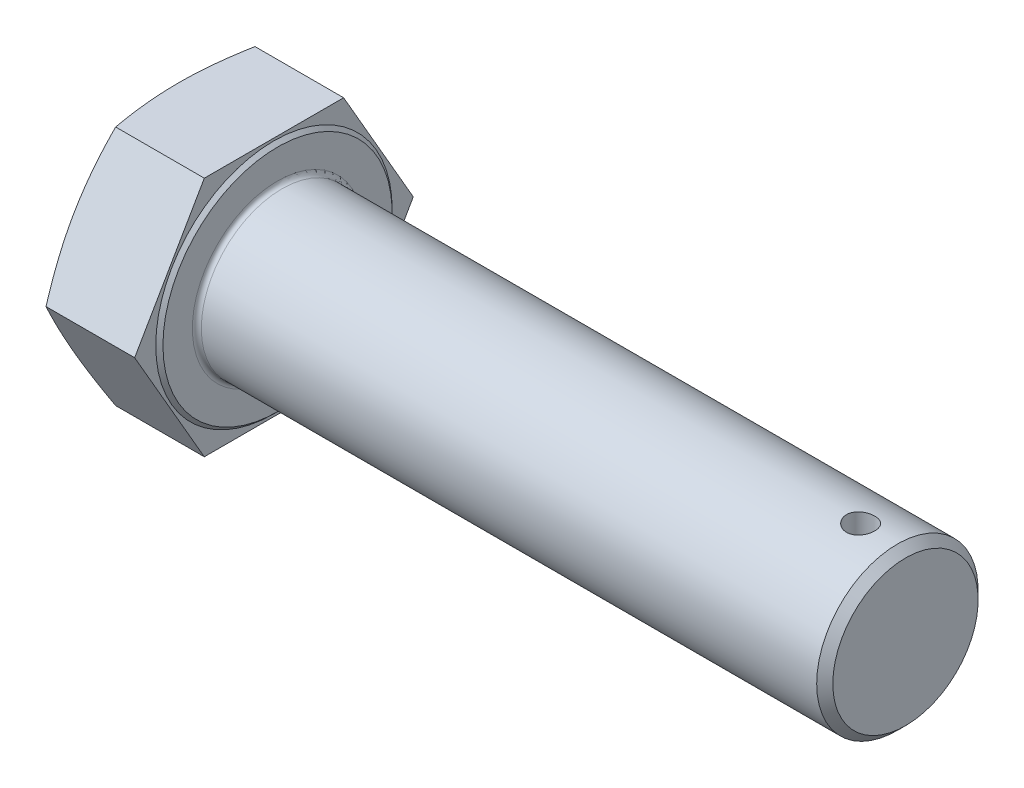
ISO-10303-21;
HEADER;
FILE_DESCRIPTION(('STEP AP214'),'2;1');
FILE_NAME('part.step','',(''),(''),'','','');
FILE_SCHEMA(('AUTOMOTIVE_DESIGN { 1 0 10303 214 1 1 1 1 }'));
ENDSEC;
DATA;
#1=APPLICATION_CONTEXT('core data for automotive mechanical design processes');
#2=APPLICATION_PROTOCOL_DEFINITION('international standard','automotive_design',2000,#1);
#3=PRODUCT_CONTEXT('',#1,'mechanical');
#4=PRODUCT('Part','Part','',(#3));
#5=PRODUCT_RELATED_PRODUCT_CATEGORY('part','',(#4));
#6=PRODUCT_DEFINITION_FORMATION('','',#4);
#7=PRODUCT_DEFINITION_CONTEXT('part definition',#1,'design');
#8=PRODUCT_DEFINITION('design','',#6,#7);
#9=PRODUCT_DEFINITION_SHAPE('','',#8);
#10=(LENGTH_UNIT() NAMED_UNIT(*) SI_UNIT(.MILLI.,.METRE.));
#11=(NAMED_UNIT(*) PLANE_ANGLE_UNIT() SI_UNIT($,.RADIAN.));
#12=(NAMED_UNIT(*) SI_UNIT($,.STERADIAN.) SOLID_ANGLE_UNIT());
#13=UNCERTAINTY_MEASURE_WITH_UNIT(LENGTH_MEASURE(1.E-05),#10,'distance_accuracy_value','');
#14=(GEOMETRIC_REPRESENTATION_CONTEXT(3) GLOBAL_UNCERTAINTY_ASSIGNED_CONTEXT((#13)) GLOBAL_UNIT_ASSIGNED_CONTEXT((#10,
#11,#12)) REPRESENTATION_CONTEXT('',''));
#15=CARTESIAN_POINT('',(0.,0.,0.));
#16=DIRECTION('',(0.,0.,1.));
#17=DIRECTION('',(1.,0.,0.));
#18=AXIS2_PLACEMENT_3D('',#15,#16,#17);
#19=CARTESIAN_POINT('',(22.08,0.,-31.0614444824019));
#20=DIRECTION('',(1.,0.,0.));
#21=DIRECTION('',(0.,0.,-1.));
#22=AXIS2_PLACEMENT_3D('',#19,#20,#21);
#23=PLANE('',#22);
#24=CARTESIAN_POINT('',(22.08,0.,0.));
#25=DIRECTION('',(1.,0.,0.));
#26=DIRECTION('',(0.,0.,-1.));
#27=AXIS2_PLACEMENT_3D('',#24,#25,#26);
#28=CIRCLE('',#27,19.);
#29=CARTESIAN_POINT('',(22.08,0.,-19.));
#30=VERTEX_POINT('',#29);
#31=EDGE_CURVE('E11',#30,#30,#28,.F.);
#32=ORIENTED_EDGE('',*,*,#31,.T.);
#33=EDGE_LOOP('',(#32));
#34=FACE_BOUND('',#33,.T.);
#35=CARTESIAN_POINT('',(22.08,0.,0.));
#36=DIRECTION('',(-1.,0.,0.));
#37=DIRECTION('',(0.,0.,1.));
#38=AXIS2_PLACEMENT_3D('',#35,#36,#37);
#39=CIRCLE('',#38,25.555);
#40=CARTESIAN_POINT('',(22.08,0.,25.555));
#41=VERTEX_POINT('',#40);
#42=EDGE_CURVE('E407',#41,#41,#39,.T.);
#43=ORIENTED_EDGE('',*,*,#42,.F.);
#44=EDGE_LOOP('',(#43));
#45=FACE_BOUND('',#44,.T.);
#46=ADVANCED_FACE('F32',(#34,#45),#23,.T.);
#47=CARTESIAN_POINT('',(22.08,-26.9,-15.5307222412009));
#48=DIRECTION('',(0.,0.5,0.866025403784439));
#49=DIRECTION('',(0.,-0.866025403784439,0.5));
#50=AXIS2_PLACEMENT_3D('',#47,#48,#49);
#51=PLANE('',#50);
#52=CARTESIAN_POINT('',(1.51468395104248,0.000200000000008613,-31.0615599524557));
#53=CARTESIAN_POINT('',(1.397628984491,-0.556880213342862,-30.739929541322));
#54=CARTESIAN_POINT('',(1.28583830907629,-1.11477913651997,-30.4178264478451));
#55=CARTESIAN_POINT('',(1.07394359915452,-2.23229041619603,-29.7726310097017));
#56=CARTESIAN_POINT('',(0.973840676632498,-2.79190293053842,-29.4495385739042));
#57=CARTESIAN_POINT('',(0.69270352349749,-4.47404053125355,-28.4783559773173));
#58=CARTESIAN_POINT('',(0.531005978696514,-5.59909558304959,-27.8288051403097));
#59=CARTESIAN_POINT('',(0.334493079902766,-7.28525346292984,-26.8553014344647));
#60=CARTESIAN_POINT('',(0.276827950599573,-7.84441085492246,-26.5324717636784));
#61=CARTESIAN_POINT('',(0.177241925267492,-8.96379540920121,-25.8861947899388));
#62=CARTESIAN_POINT('',(0.135321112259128,-9.52402257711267,-25.5627474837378));
#63=CARTESIAN_POINT('',(0.0679605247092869,-10.6450156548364,-24.9155418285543));
#64=CARTESIAN_POINT('',(0.0425147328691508,-11.2057812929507,-24.5917836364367));
#65=CARTESIAN_POINT('',(0.00853449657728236,-12.3276979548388,-23.9440447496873));
#66=CARTESIAN_POINT('',(0.,-12.8888489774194,-23.6200640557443));
#67=CARTESIAN_POINT('',(0.,-14.0111510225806,-22.9721026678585));
#68=CARTESIAN_POINT('',(0.00853449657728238,-14.5723020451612,-22.6481219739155));
#69=CARTESIAN_POINT('',(0.0425147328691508,-15.6942187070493,-22.0003830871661));
#70=CARTESIAN_POINT('',(0.0679605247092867,-16.2549843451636,-21.6766248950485));
#71=CARTESIAN_POINT('',(0.135321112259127,-17.3759774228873,-21.029419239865));
#72=CARTESIAN_POINT('',(0.17724192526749,-17.9362045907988,-20.705971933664));
#73=CARTESIAN_POINT('',(0.276827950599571,-19.0555891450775,-20.0596949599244));
#74=CARTESIAN_POINT('',(0.334493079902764,-19.6147465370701,-19.7368652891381));
#75=CARTESIAN_POINT('',(0.531005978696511,-21.3009044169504,-18.7633615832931));
#76=CARTESIAN_POINT('',(0.692703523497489,-22.4259594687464,-18.1138107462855));
#77=CARTESIAN_POINT('',(0.973840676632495,-24.1080970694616,-17.1426281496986));
#78=CARTESIAN_POINT('',(1.07394359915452,-24.667709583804,-16.8195357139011));
#79=CARTESIAN_POINT('',(1.28583830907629,-25.78522086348,-16.1743402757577));
#80=CARTESIAN_POINT('',(1.39762898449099,-26.3431197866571,-15.8522371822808));
#81=CARTESIAN_POINT('',(1.51468395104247,-26.9002,-15.5306067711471));
#82=B_SPLINE_CURVE_WITH_KNOTS('',3,(#52,#53,#54,#55,#56,#57,#58,#59,#60,#61,#62,#63,#64,#65,#66,
#67,#68,#69,#70,#71,#72,#73,#74,#75,#76,#77,#78,#79,#80,#81),.UNSPECIFIED.,.F.,.F.,(4,2,2,2,2,2,
2,2,2,2,2,2,2,2,4),(0.,1.96141494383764,3.92301634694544,7.84893078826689,9.79346540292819,
11.7380102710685,13.6818445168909,15.6256727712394,17.569501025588,19.5133352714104,
21.4578801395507,23.402414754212,27.3283291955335,29.2899305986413,31.2513455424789),.UNSPECIFIED.);
#83=CARTESIAN_POINT('',(1.51464192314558,0.,-31.0614444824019));
#84=VERTEX_POINT('',#83);
#85=CARTESIAN_POINT('',(0.,-13.45,-23.2960833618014));
#86=VERTEX_POINT('',#85);
#87=EDGE_CURVE('E111',#84,#86,#82,.T.);
#88=ORIENTED_EDGE('',*,*,#87,.F.);
#89=DIRECTION('',(-1.,0.,0.));
#90=VECTOR('',#89,1.);
#91=CARTESIAN_POINT('',(22.08,0.,-31.0614444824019));
#92=LINE('',#91,#90);
#93=CARTESIAN_POINT('',(21.28,0.,-31.0614444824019));
#94=VERTEX_POINT('',#93);
#95=EDGE_CURVE('E140',#94,#84,#92,.T.);
#96=ORIENTED_EDGE('',*,*,#95,.F.);
#97=DIRECTION('',(0.,0.866025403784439,-0.5));
#98=VECTOR('',#97,1.);
#99=CARTESIAN_POINT('',(21.28,-26.9,-15.5307222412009));
#100=LINE('',#99,#98);
#101=CARTESIAN_POINT('',(21.28,-26.9,-15.530722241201));
#102=VERTEX_POINT('',#101);
#103=EDGE_CURVE('E396',#102,#94,#100,.T.);
#104=ORIENTED_EDGE('',*,*,#103,.F.);
#105=DIRECTION('',(-1.,0.,0.));
#106=VECTOR('',#105,1.);
#107=CARTESIAN_POINT('',(22.08,-26.9,-15.5307222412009));
#108=LINE('',#107,#106);
#109=CARTESIAN_POINT('',(1.51464192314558,-26.9,-15.530722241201));
#110=VERTEX_POINT('',#109);
#111=EDGE_CURVE('E134',#102,#110,#108,.T.);
#112=ORIENTED_EDGE('',*,*,#111,.T.);
#113=EDGE_CURVE('E233',#86,#110,#82,.T.);
#114=ORIENTED_EDGE('',*,*,#113,.F.);
#115=EDGE_LOOP('',(#88,#96,#104,#112,#114));
#116=FACE_BOUND('',#115,.T.);
#117=ADVANCED_FACE('F34',(#116),#51,.F.);
#118=CARTESIAN_POINT('',(22.08,0.,-31.0614444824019));
#119=DIRECTION('',(0.,-0.500000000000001,0.866025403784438));
#120=DIRECTION('',(0.,-0.866025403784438,-0.500000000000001));
#121=AXIS2_PLACEMENT_3D('',#118,#119,#120);
#122=PLANE('',#121);
#123=CARTESIAN_POINT('',(1.51468395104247,26.9002,-15.5306067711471));
#124=CARTESIAN_POINT('',(1.39762898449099,26.3431197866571,-15.8522371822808));
#125=CARTESIAN_POINT('',(1.28583830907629,25.78522086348,-16.1743402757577));
#126=CARTESIAN_POINT('',(1.07394359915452,24.667709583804,-16.8195357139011));
#127=CARTESIAN_POINT('',(0.973840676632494,24.1080970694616,-17.1426281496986));
#128=CARTESIAN_POINT('',(0.692703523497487,22.4259594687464,-18.1138107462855));
#129=CARTESIAN_POINT('',(0.531005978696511,21.3009044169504,-18.7633615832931));
#130=CARTESIAN_POINT('',(0.334493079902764,19.6147465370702,-19.7368652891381));
#131=CARTESIAN_POINT('',(0.276827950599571,19.0555891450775,-20.0596949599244));
#132=CARTESIAN_POINT('',(0.17724192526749,17.9362045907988,-20.705971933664));
#133=CARTESIAN_POINT('',(0.135321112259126,17.3759774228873,-21.029419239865));
#134=CARTESIAN_POINT('',(0.0679605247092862,16.2549843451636,-21.6766248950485));
#135=CARTESIAN_POINT('',(0.042514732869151,15.6942187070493,-22.0003830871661));
#136=CARTESIAN_POINT('',(0.00853449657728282,14.5723020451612,-22.6481219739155));
#137=CARTESIAN_POINT('',(0.,14.0111510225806,-22.9721026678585));
#138=CARTESIAN_POINT('',(0.,12.8888489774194,-23.6200640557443));
#139=CARTESIAN_POINT('',(0.00853449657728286,12.3276979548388,-23.9440447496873));
#140=CARTESIAN_POINT('',(0.0425147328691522,11.2057812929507,-24.5917836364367));
#141=CARTESIAN_POINT('',(0.0679605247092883,10.6450156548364,-24.9155418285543));
#142=CARTESIAN_POINT('',(0.13532111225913,9.52402257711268,-25.5627474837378));
#143=CARTESIAN_POINT('',(0.177241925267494,8.96379540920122,-25.8861947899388));
#144=CARTESIAN_POINT('',(0.276827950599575,7.84441085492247,-26.5324717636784));
#145=CARTESIAN_POINT('',(0.334493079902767,7.28525346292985,-26.8553014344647));
#146=CARTESIAN_POINT('',(0.531005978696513,5.5990955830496,-27.8288051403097));
#147=CARTESIAN_POINT('',(0.692703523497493,4.47404053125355,-28.4783559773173));
#148=CARTESIAN_POINT('',(0.9738406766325,2.79190293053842,-29.4495385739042));
#149=CARTESIAN_POINT('',(1.07394359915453,2.23229041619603,-29.7726310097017));
#150=CARTESIAN_POINT('',(1.28583830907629,1.11477913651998,-30.4178264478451));
#151=CARTESIAN_POINT('',(1.397628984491,0.556880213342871,-30.739929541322));
#152=CARTESIAN_POINT('',(1.51468395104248,-0.000199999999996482,-31.0615599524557));
#153=B_SPLINE_CURVE_WITH_KNOTS('',3,(#123,#124,#125,#126,#127,#128,#129,#130,#131,#132,#133,
#134,#135,#136,#137,#138,#139,#140,#141,#142,#143,#144,#145,#146,#147,#148,#149,#150,#151,#152),
.UNSPECIFIED.,.F.,.F.,(4,2,2,2,2,2,2,2,2,2,2,2,2,2,4),(0.,1.96141494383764,3.92301634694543,
7.84893078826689,9.79346540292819,11.7380102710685,13.6818445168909,15.6256727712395,
17.569501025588,19.5133352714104,21.4578801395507,23.402414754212,27.3283291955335,
29.2899305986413,31.2513455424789),.UNSPECIFIED.);
#154=CARTESIAN_POINT('',(1.51464192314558,26.9,-15.530722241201));
#155=VERTEX_POINT('',#154);
#156=CARTESIAN_POINT('',(0.,13.45,-23.2960833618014));
#157=VERTEX_POINT('',#156);
#158=EDGE_CURVE('E244',#155,#157,#153,.T.);
#159=ORIENTED_EDGE('',*,*,#158,.F.);
#160=DIRECTION('',(-1.,0.,0.));
#161=VECTOR('',#160,1.);
#162=CARTESIAN_POINT('',(22.08,26.9,-15.5307222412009));
#163=LINE('',#162,#161);
#164=CARTESIAN_POINT('',(21.28,26.9,-15.530722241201));
#165=VERTEX_POINT('',#164);
#166=EDGE_CURVE('E131',#165,#155,#163,.T.);
#167=ORIENTED_EDGE('',*,*,#166,.F.);
#168=DIRECTION('',(0.,0.866025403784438,0.500000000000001));
#169=VECTOR('',#168,1.);
#170=CARTESIAN_POINT('',(21.28,0.,-31.0614444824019));
#171=LINE('',#170,#169);
#172=EDGE_CURVE('E398',#94,#165,#171,.T.);
#173=ORIENTED_EDGE('',*,*,#172,.F.);
#174=ORIENTED_EDGE('',*,*,#95,.T.);
#175=EDGE_CURVE('E122',#157,#84,#153,.T.);
#176=ORIENTED_EDGE('',*,*,#175,.F.);
#177=EDGE_LOOP('',(#159,#167,#173,#174,#176));
#178=FACE_BOUND('',#177,.T.);
#179=ADVANCED_FACE('F195',(#178),#122,.F.);
#180=CARTESIAN_POINT('',(22.08,26.9,-15.5307222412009));
#181=DIRECTION('',(0.,-1.,0.));
#182=DIRECTION('',(0.,0.,-1.));
#183=AXIS2_PLACEMENT_3D('',#180,#181,#182);
#184=PLANE('',#183);
#185=CARTESIAN_POINT('',(8.09364576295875,26.9,-41.1198915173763));
#186=CARTESIAN_POINT('',(7.90830433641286,26.9,-40.5113738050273));
#187=CARTESIAN_POINT('',(7.72408376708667,26.9,-39.9025148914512));
#188=CARTESIAN_POINT('',(7.35813527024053,26.9,-38.6840447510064));
#189=CARTESIAN_POINT('',(7.17640735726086,26.9,-38.0744335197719));
#190=CARTESIAN_POINT('',(6.63531556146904,26.9,-36.2442869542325));
#191=CARTESIAN_POINT('',(6.28007109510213,26.9,-35.0225286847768));
#192=CARTESIAN_POINT('',(5.58244747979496,26.9,-32.5728705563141));
#193=CARTESIAN_POINT('',(5.24009357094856,26.9,-31.3449634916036));
#194=CARTESIAN_POINT('',(4.5722297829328,26.9,-28.8845822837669));
#195=CARTESIAN_POINT('',(4.24671960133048,26.9,-27.6521082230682));
#196=CARTESIAN_POINT('',(3.62060798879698,26.9,-25.197000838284));
#197=CARTESIAN_POINT('',(3.31974892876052,26.9,-23.9744335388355));
#198=CARTESIAN_POINT('',(2.74364501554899,26.9,-21.5232150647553));
#199=CARTESIAN_POINT('',(2.46840059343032,26.9,-20.2945637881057));
#200=CARTESIAN_POINT('',(1.94994322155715,26.9,-17.830903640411));
#201=CARTESIAN_POINT('',(1.70671934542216,26.9,-16.5958970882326));
#202=CARTESIAN_POINT('',(1.2597103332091,26.9,-14.118710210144));
#203=CARTESIAN_POINT('',(1.05592387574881,26.9,-12.8765301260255));
#204=CARTESIAN_POINT('',(0.716241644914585,26.9,-10.5248872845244));
#205=CARTESIAN_POINT('',(0.575295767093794,26.9,-9.41615943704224));
#206=CARTESIAN_POINT('',(0.336719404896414,26.9,-7.19397240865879));
#207=CARTESIAN_POINT('',(0.239087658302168,26.9,-6.08051336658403));
#208=CARTESIAN_POINT('',(0.12859399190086,26.9,-4.40838470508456));
#209=CARTESIAN_POINT('',(0.0977591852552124,26.9,-3.85086246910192));
#210=CARTESIAN_POINT('',(0.0484239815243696,26.9,-2.73527685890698));
#211=CARTESIAN_POINT('',(0.0299232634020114,26.9,-2.17721349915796));
#212=CARTESIAN_POINT('',(0.0055107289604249,26.9,-1.06080724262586));
#213=CARTESIAN_POINT('',(-0.000400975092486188,26.9,-0.502464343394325));
#214=CARTESIAN_POINT('',(0.000443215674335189,26.9,0.614211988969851));
#215=CARTESIAN_POINT('',(0.0071991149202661,26.9,1.17254542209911));
#216=CARTESIAN_POINT('',(0.0333546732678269,26.9,2.29174099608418));
#217=CARTESIAN_POINT('',(0.0528180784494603,26.9,2.85260165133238));
#218=CARTESIAN_POINT('',(0.104180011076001,26.9,3.97375773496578));
#219=CARTESIAN_POINT('',(0.136078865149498,26.9,4.5340531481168));
#220=CARTESIAN_POINT('',(0.249841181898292,26.9,6.21369861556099));
#221=CARTESIAN_POINT('',(0.349771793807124,26.9,7.331864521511));
#222=CARTESIAN_POINT('',(0.593196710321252,26.9,9.56430663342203));
#223=CARTESIAN_POINT('',(0.736728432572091,26.9,10.6785786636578));
#224=CARTESIAN_POINT('',(1.06151792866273,26.9,12.9015599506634));
#225=CARTESIAN_POINT('',(1.24277590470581,26.9,14.0102691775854));
#226=CARTESIAN_POINT('',(1.64755311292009,26.9,16.2804519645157));
#227=CARTESIAN_POINT('',(1.87280061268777,26.9,17.4416144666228));
#228=CARTESIAN_POINT('',(2.35228601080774,26.9,19.7579775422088));
#229=CARTESIAN_POINT('',(2.60652609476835,26.9,20.9131776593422));
#230=CARTESIAN_POINT('',(3.13865846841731,26.9,23.2184379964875));
#231=CARTESIAN_POINT('',(3.41655762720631,26.9,24.3684966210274));
#232=CARTESIAN_POINT('',(3.99148746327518,26.9,26.6637692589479));
#233=CARTESIAN_POINT('',(4.28851768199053,26.9,27.8089833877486));
#234=CARTESIAN_POINT('',(4.89852507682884,26.9,30.0967168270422));
#235=CARTESIAN_POINT('',(5.21152224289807,26.9,31.2392307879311));
#236=CARTESIAN_POINT('',(5.85024897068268,26.9,33.5206892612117));
#237=CARTESIAN_POINT('',(6.17597858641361,26.9,34.6596337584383));
#238=CARTESIAN_POINT('',(6.83783976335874,26.9,36.9342824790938));
#239=CARTESIAN_POINT('',(7.1739695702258,26.9,38.069987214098));
#240=CARTESIAN_POINT('',(7.85487614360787,26.9,40.338794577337));
#241=CARTESIAN_POINT('',(8.19965289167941,26.9,41.4718972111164));
#242=CARTESIAN_POINT('',(8.89256675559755,26.9,43.7233837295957));
#243=CARTESIAN_POINT('',(9.24062474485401,26.9,44.8417919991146));
#244=CARTESIAN_POINT('',(9.94266960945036,26.9,47.0767443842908));
#245=CARTESIAN_POINT('',(10.2966564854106,26.9,48.193288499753));
#246=CARTESIAN_POINT('',(11.009668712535,26.9,50.4248218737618));
#247=CARTESIAN_POINT('',(11.3686942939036,26.9,51.5398110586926));
#248=CARTESIAN_POINT('',(12.0910295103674,26.9,53.7684011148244));
#249=CARTESIAN_POINT('',(12.4543391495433,26.9,54.8820019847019));
#250=CARTESIAN_POINT('',(13.1832494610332,26.9,57.1037718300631));
#251=CARTESIAN_POINT('',(13.5488362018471,26.9,58.211945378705));
#252=CARTESIAN_POINT('',(14.2831644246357,26.9,60.4272469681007));
#253=CARTESIAN_POINT('',(14.6519059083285,26.9,61.5343750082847));
#254=CARTESIAN_POINT('',(15.3920975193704,26.9,63.7476240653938));
#255=CARTESIAN_POINT('',(15.763547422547,26.9,64.8537451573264));
#256=CARTESIAN_POINT('',(16.5088507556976,26.9,67.065174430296));
#257=CARTESIAN_POINT('',(16.8827041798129,26.9,68.1704826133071));
#258=CARTESIAN_POINT('',(17.2575927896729,26.9,69.2754387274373));
#259=B_SPLINE_CURVE_WITH_KNOTS('',3,(#185,#186,#187,#188,#189,#190,#191,#192,#193,#194,#195,
#196,#197,#198,#199,#200,#201,#202,#203,#204,#205,#206,#207,#208,#209,#210,#211,#212,#213,#214,
#215,#216,#217,#218,#219,#220,#221,#222,#223,#224,#225,#226,#227,#228,#229,#230,#231,#232,#233,
#234,#235,#236,#237,#238,#239,#240,#241,#242,#243,#244,#245,#246,#247,#248,#249,#250,#251,#252,
#253,#254,#255,#256,#257,#258),.UNSPECIFIED.,.F.,.F.,(4,2,2,2,2,2,2,2,2,2,2,2,2,2,2,2,2,2,2,2,2,
2,2,2,2,2,2,2,2,2,2,2,2,2,2,2,4),(0.,1.90834994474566,3.81671101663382,7.63371526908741,
11.4578411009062,15.2818982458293,19.0588067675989,22.8357788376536,26.6114587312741,
30.3870120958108,33.7392539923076,37.0913981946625,38.7664069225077,40.4413720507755,
42.1163521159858,43.7913327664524,45.4747810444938,47.158273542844,50.5250887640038,
53.8948015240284,57.2645323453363,60.8125045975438,64.3607444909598,67.9100181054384,
71.459206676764,75.0129532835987,78.5667149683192,82.1198804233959,85.6730383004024,
89.1869673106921,92.700896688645,96.214987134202,99.7290809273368,103.229835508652,
106.730591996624,110.231061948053,113.731523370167),.UNSPECIFIED.);
#260=CARTESIAN_POINT('',(1.51464192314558,26.9,15.5307222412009));
#261=VERTEX_POINT('',#260);
#262=CARTESIAN_POINT('',(0.,26.9,0.));
#263=VERTEX_POINT('',#262);
#264=EDGE_CURVE('E48',#261,#263,#259,.F.);
#265=ORIENTED_EDGE('',*,*,#264,.F.);
#266=DIRECTION('',(-1.,0.,0.));
#267=VECTOR('',#266,1.);
#268=CARTESIAN_POINT('',(22.08,26.9,15.5307222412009));
#269=LINE('',#268,#267);
#270=CARTESIAN_POINT('',(21.28,26.9,15.5307222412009));
#271=VERTEX_POINT('',#270);
#272=EDGE_CURVE('E128',#271,#261,#269,.T.);
#273=ORIENTED_EDGE('',*,*,#272,.F.);
#274=DIRECTION('',(0.,0.,1.));
#275=VECTOR('',#274,1.);
#276=CARTESIAN_POINT('',(21.28,26.9,-15.5307222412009));
#277=LINE('',#276,#275);
#278=EDGE_CURVE('E400',#165,#271,#277,.T.);
#279=ORIENTED_EDGE('',*,*,#278,.F.);
#280=ORIENTED_EDGE('',*,*,#166,.T.);
#281=EDGE_CURVE('E245',#263,#155,#259,.F.);
#282=ORIENTED_EDGE('',*,*,#281,.F.);
#283=EDGE_LOOP('',(#265,#273,#279,#280,#282));
#284=FACE_BOUND('',#283,.T.);
#285=ADVANCED_FACE('F253',(#284),#184,.F.);
#286=CARTESIAN_POINT('',(22.08,26.9,15.5307222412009));
#287=DIRECTION('',(0.,-0.5,-0.866025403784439));
#288=DIRECTION('',(0.,0.866025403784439,-0.5));
#289=AXIS2_PLACEMENT_3D('',#286,#287,#288);
#290=PLANE('',#289);
#291=CARTESIAN_POINT('',(1.51468395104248,-0.000199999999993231,31.0615599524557));
#292=CARTESIAN_POINT('',(1.39762898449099,0.556880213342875,30.739929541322));
#293=CARTESIAN_POINT('',(1.28583830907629,1.11477913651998,30.4178264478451));
#294=CARTESIAN_POINT('',(1.07394359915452,2.23229041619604,29.7726310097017));
#295=CARTESIAN_POINT('',(0.973840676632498,2.79190293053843,29.4495385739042));
#296=CARTESIAN_POINT('',(0.692703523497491,4.47404053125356,28.4783559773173));
#297=CARTESIAN_POINT('',(0.531005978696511,5.5990955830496,27.8288051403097));
#298=CARTESIAN_POINT('',(0.334493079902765,7.28525346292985,26.8553014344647));
#299=CARTESIAN_POINT('',(0.276827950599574,7.84441085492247,26.5324717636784));
#300=CARTESIAN_POINT('',(0.177241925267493,8.96379540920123,25.8861947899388));
#301=CARTESIAN_POINT('',(0.135321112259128,9.52402257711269,25.5627474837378));
#302=CARTESIAN_POINT('',(0.0679605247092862,10.6450156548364,24.9155418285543));
#303=CARTESIAN_POINT('',(0.0425147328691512,11.2057812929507,24.5917836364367));
#304=CARTESIAN_POINT('',(0.00853449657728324,12.3276979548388,23.9440447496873));
#305=CARTESIAN_POINT('',(0.,12.8888489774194,23.6200640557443));
#306=CARTESIAN_POINT('',(0.,14.0111510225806,22.9721026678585));
#307=CARTESIAN_POINT('',(0.00853449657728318,14.5723020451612,22.6481219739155));
#308=CARTESIAN_POINT('',(0.0425147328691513,15.6942187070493,22.0003830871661));
#309=CARTESIAN_POINT('',(0.0679605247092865,16.2549843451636,21.6766248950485));
#310=CARTESIAN_POINT('',(0.135321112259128,17.3759774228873,21.029419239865));
#311=CARTESIAN_POINT('',(0.177241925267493,17.9362045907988,20.705971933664));
#312=CARTESIAN_POINT('',(0.276827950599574,19.0555891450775,20.0596949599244));
#313=CARTESIAN_POINT('',(0.334493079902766,19.6147465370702,19.7368652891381));
#314=CARTESIAN_POINT('',(0.531005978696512,21.3009044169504,18.7633615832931));
#315=CARTESIAN_POINT('',(0.692703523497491,22.4259594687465,18.1138107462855));
#316=CARTESIAN_POINT('',(0.973840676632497,24.1080970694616,17.1426281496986));
#317=CARTESIAN_POINT('',(1.07394359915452,24.667709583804,16.8195357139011));
#318=CARTESIAN_POINT('',(1.28583830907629,25.78522086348,16.1743402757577));
#319=CARTESIAN_POINT('',(1.39762898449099,26.3431197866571,15.8522371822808));
#320=CARTESIAN_POINT('',(1.51468395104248,26.9002,15.5306067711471));
#321=B_SPLINE_CURVE_WITH_KNOTS('',3,(#291,#292,#293,#294,#295,#296,#297,#298,#299,#300,#301,
#302,#303,#304,#305,#306,#307,#308,#309,#310,#311,#312,#313,#314,#315,#316,#317,#318,#319,#320),
.UNSPECIFIED.,.F.,.F.,(4,2,2,2,2,2,2,2,2,2,2,2,2,2,4),(0.,1.96141494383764,3.92301634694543,
7.84893078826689,9.79346540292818,11.7380102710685,13.6818445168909,15.6256727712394,
17.569501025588,19.5133352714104,21.4578801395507,23.402414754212,27.3283291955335,
29.2899305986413,31.2513455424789),.UNSPECIFIED.);
#322=CARTESIAN_POINT('',(1.51464192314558,0.,31.0614444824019));
#323=VERTEX_POINT('',#322);
#324=CARTESIAN_POINT('',(0.,13.45,23.2960833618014));
#325=VERTEX_POINT('',#324);
#326=EDGE_CURVE('E56',#323,#325,#321,.T.);
#327=ORIENTED_EDGE('',*,*,#326,.F.);
#328=DIRECTION('',(-1.,0.,0.));
#329=VECTOR('',#328,1.);
#330=CARTESIAN_POINT('',(22.08,0.,31.0614444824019));
#331=LINE('',#330,#329);
#332=CARTESIAN_POINT('',(21.28,0.,31.0614444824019));
#333=VERTEX_POINT('',#332);
#334=EDGE_CURVE('E119',#333,#323,#331,.T.);
#335=ORIENTED_EDGE('',*,*,#334,.F.);
#336=DIRECTION('',(0.,-0.866025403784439,0.5));
#337=VECTOR('',#336,1.);
#338=CARTESIAN_POINT('',(21.28,26.9,15.5307222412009));
#339=LINE('',#338,#337);
#340=EDGE_CURVE('E404',#271,#333,#339,.T.);
#341=ORIENTED_EDGE('',*,*,#340,.F.);
#342=ORIENTED_EDGE('',*,*,#272,.T.);
#343=EDGE_CURVE('E121',#325,#261,#321,.T.);
#344=ORIENTED_EDGE('',*,*,#343,.F.);
#345=EDGE_LOOP('',(#327,#335,#341,#342,#344));
#346=FACE_BOUND('',#345,.T.);
#347=ADVANCED_FACE('F117',(#346),#290,.F.);
#348=CARTESIAN_POINT('',(22.08,0.,31.0614444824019));
#349=DIRECTION('',(0.,0.5,-0.866025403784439));
#350=DIRECTION('',(0.,0.866025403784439,0.5));
#351=AXIS2_PLACEMENT_3D('',#348,#349,#350);
#352=PLANE('',#351);
#353=CARTESIAN_POINT('',(1.51468395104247,-26.9002,15.5306067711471));
#354=CARTESIAN_POINT('',(1.39762898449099,-26.3431197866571,15.8522371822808));
#355=CARTESIAN_POINT('',(1.28583830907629,-25.78522086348,16.1743402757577));
#356=CARTESIAN_POINT('',(1.07394359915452,-24.667709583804,16.8195357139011));
#357=CARTESIAN_POINT('',(0.973840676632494,-24.1080970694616,17.1426281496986));
#358=CARTESIAN_POINT('',(0.692703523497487,-22.4259594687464,18.1138107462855));
#359=CARTESIAN_POINT('',(0.531005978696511,-21.3009044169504,18.7633615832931));
#360=CARTESIAN_POINT('',(0.334493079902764,-19.6147465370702,19.7368652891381));
#361=CARTESIAN_POINT('',(0.276827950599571,-19.0555891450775,20.0596949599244));
#362=CARTESIAN_POINT('',(0.17724192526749,-17.9362045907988,20.705971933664));
#363=CARTESIAN_POINT('',(0.135321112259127,-17.3759774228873,21.029419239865));
#364=CARTESIAN_POINT('',(0.0679605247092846,-16.2549843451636,21.6766248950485));
#365=CARTESIAN_POINT('',(0.0425147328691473,-15.6942187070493,22.0003830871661));
#366=CARTESIAN_POINT('',(0.00853449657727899,-14.5723020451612,22.6481219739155));
#367=CARTESIAN_POINT('',(0.,-14.0111510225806,22.9721026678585));
#368=CARTESIAN_POINT('',(0.,-12.8888489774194,23.6200640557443));
#369=CARTESIAN_POINT('',(0.008534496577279,-12.3276979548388,23.9440447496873));
#370=CARTESIAN_POINT('',(0.0425147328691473,-11.2057812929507,24.5917836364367));
#371=CARTESIAN_POINT('',(0.0679605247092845,-10.6450156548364,24.9155418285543));
#372=CARTESIAN_POINT('',(0.135321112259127,-9.52402257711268,25.5627474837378));
#373=CARTESIAN_POINT('',(0.177241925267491,-8.96379540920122,25.8861947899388));
#374=CARTESIAN_POINT('',(0.276827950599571,-7.84441085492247,26.5324717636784));
#375=CARTESIAN_POINT('',(0.334493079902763,-7.28525346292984,26.8553014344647));
#376=CARTESIAN_POINT('',(0.531005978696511,-5.59909558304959,27.8288051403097));
#377=CARTESIAN_POINT('',(0.692703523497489,-4.47404053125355,28.4783559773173));
#378=CARTESIAN_POINT('',(0.973840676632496,-2.79190293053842,29.4495385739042));
#379=CARTESIAN_POINT('',(1.07394359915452,-2.23229041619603,29.7726310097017));
#380=CARTESIAN_POINT('',(1.28583830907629,-1.11477913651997,30.4178264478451));
#381=CARTESIAN_POINT('',(1.39762898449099,-0.556880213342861,30.739929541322));
#382=CARTESIAN_POINT('',(1.51468395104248,0.000200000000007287,31.0615599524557));
#383=B_SPLINE_CURVE_WITH_KNOTS('',3,(#353,#354,#355,#356,#357,#358,#359,#360,#361,#362,#363,
#364,#365,#366,#367,#368,#369,#370,#371,#372,#373,#374,#375,#376,#377,#378,#379,#380,#381,#382),
.UNSPECIFIED.,.F.,.F.,(4,2,2,2,2,2,2,2,2,2,2,2,2,2,4),(0.,1.96141494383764,3.92301634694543,
7.84893078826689,9.79346540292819,11.7380102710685,13.6818445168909,15.6256727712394,
17.569501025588,19.5133352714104,21.4578801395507,23.402414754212,27.3283291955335,
29.2899305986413,31.2513455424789),.UNSPECIFIED.);
#384=CARTESIAN_POINT('',(1.51464192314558,-26.9,15.530722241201));
#385=VERTEX_POINT('',#384);
#386=CARTESIAN_POINT('',(0.,-13.45,23.2960833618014));
#387=VERTEX_POINT('',#386);
#388=EDGE_CURVE('E113',#385,#387,#383,.T.);
#389=ORIENTED_EDGE('',*,*,#388,.F.);
#390=DIRECTION('',(-1.,0.,0.));
#391=VECTOR('',#390,1.);
#392=CARTESIAN_POINT('',(22.08,-26.9,15.5307222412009));
#393=LINE('',#392,#391);
#394=CARTESIAN_POINT('',(21.28,-26.9,15.5307222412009));
#395=VERTEX_POINT('',#394);
#396=EDGE_CURVE('E129',#395,#385,#393,.T.);
#397=ORIENTED_EDGE('',*,*,#396,.F.);
#398=DIRECTION('',(0.,-0.866025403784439,-0.5));
#399=VECTOR('',#398,1.);
#400=CARTESIAN_POINT('',(21.28,0.,31.0614444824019));
#401=LINE('',#400,#399);
#402=EDGE_CURVE('E127',#333,#395,#401,.T.);
#403=ORIENTED_EDGE('',*,*,#402,.F.);
#404=ORIENTED_EDGE('',*,*,#334,.T.);
#405=EDGE_CURVE('E103',#387,#323,#383,.T.);
#406=ORIENTED_EDGE('',*,*,#405,.F.);
#407=EDGE_LOOP('',(#389,#397,#403,#404,#406));
#408=FACE_BOUND('',#407,.T.);
#409=ADVANCED_FACE('F125',(#408),#352,.F.);
#410=CARTESIAN_POINT('',(22.08,-26.9,15.5307222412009));
#411=DIRECTION('',(0.,1.,0.));
#412=DIRECTION('',(0.,0.,1.));
#413=AXIS2_PLACEMENT_3D('',#410,#411,#412);
#414=PLANE('',#413);
#415=CARTESIAN_POINT('',(8.09364576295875,-26.9,-41.1198915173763));
#416=CARTESIAN_POINT('',(7.90830433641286,-26.9,-40.5113738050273));
#417=CARTESIAN_POINT('',(7.72408376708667,-26.9,-39.9025148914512));
#418=CARTESIAN_POINT('',(7.35813527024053,-26.9,-38.6840447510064));
#419=CARTESIAN_POINT('',(7.17640735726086,-26.9,-38.0744335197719));
#420=CARTESIAN_POINT('',(6.63531556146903,-26.9,-36.2442869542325));
#421=CARTESIAN_POINT('',(6.28007109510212,-26.9,-35.0225286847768));
#422=CARTESIAN_POINT('',(5.58244747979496,-26.9,-32.5728705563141));
#423=CARTESIAN_POINT('',(5.24009357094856,-26.9,-31.3449634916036));
#424=CARTESIAN_POINT('',(4.5722297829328,-26.9,-28.8845822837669));
#425=CARTESIAN_POINT('',(4.24671960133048,-26.9,-27.6521082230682));
#426=CARTESIAN_POINT('',(3.62060798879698,-26.9,-25.197000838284));
#427=CARTESIAN_POINT('',(3.31974892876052,-26.9,-23.9744335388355));
#428=CARTESIAN_POINT('',(2.74364501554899,-26.9,-21.5232150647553));
#429=CARTESIAN_POINT('',(2.46840059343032,-26.9,-20.2945637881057));
#430=CARTESIAN_POINT('',(1.94994322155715,-26.9,-17.830903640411));
#431=CARTESIAN_POINT('',(1.70671934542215,-26.9,-16.5958970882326));
#432=CARTESIAN_POINT('',(1.2597103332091,-26.9,-14.118710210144));
#433=CARTESIAN_POINT('',(1.05592387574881,-26.9,-12.8765301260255));
#434=CARTESIAN_POINT('',(0.716241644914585,-26.9,-10.5248872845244));
#435=CARTESIAN_POINT('',(0.575295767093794,-26.9,-9.41615943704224));
#436=CARTESIAN_POINT('',(0.336719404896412,-26.9,-7.19397240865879));
#437=CARTESIAN_POINT('',(0.239087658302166,-26.9,-6.08051336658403));
#438=CARTESIAN_POINT('',(0.128593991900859,-26.9,-4.40838470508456));
#439=CARTESIAN_POINT('',(0.0977591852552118,-26.9,-3.85086246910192));
#440=CARTESIAN_POINT('',(0.0484239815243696,-26.9,-2.73527685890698));
#441=CARTESIAN_POINT('',(0.0299232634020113,-26.9,-2.17721349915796));
#442=CARTESIAN_POINT('',(0.00551072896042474,-26.9,-1.06080724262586));
#443=CARTESIAN_POINT('',(-0.000400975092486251,-26.9,-0.502464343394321));
#444=CARTESIAN_POINT('',(0.000443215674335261,-26.9,0.614211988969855));
#445=CARTESIAN_POINT('',(0.00719911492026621,-26.9,1.17254542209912));
#446=CARTESIAN_POINT('',(0.0333546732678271,-26.9,2.29174099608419));
#447=CARTESIAN_POINT('',(0.0528180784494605,-26.9,2.85260165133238));
#448=CARTESIAN_POINT('',(0.104180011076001,-26.9,3.97375773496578));
#449=CARTESIAN_POINT('',(0.136078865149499,-26.9,4.5340531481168));
#450=CARTESIAN_POINT('',(0.249841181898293,-26.9,6.21369861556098));
#451=CARTESIAN_POINT('',(0.349771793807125,-26.9,7.33186452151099));
#452=CARTESIAN_POINT('',(0.593196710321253,-26.9,9.56430663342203));
#453=CARTESIAN_POINT('',(0.736728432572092,-26.9,10.6785786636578));
#454=CARTESIAN_POINT('',(1.06151792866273,-26.9,12.9015599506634));
#455=CARTESIAN_POINT('',(1.24277590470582,-26.9,14.0102691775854));
#456=CARTESIAN_POINT('',(1.64755311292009,-26.9,16.2804519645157));
#457=CARTESIAN_POINT('',(1.87280061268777,-26.9,17.4416144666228));
#458=CARTESIAN_POINT('',(2.35228601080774,-26.9,19.7579775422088));
#459=CARTESIAN_POINT('',(2.60652609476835,-26.9,20.9131776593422));
#460=CARTESIAN_POINT('',(3.13865846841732,-26.9,23.2184379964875));
#461=CARTESIAN_POINT('',(3.41655762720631,-26.9,24.3684966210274));
#462=CARTESIAN_POINT('',(3.99148746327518,-26.9,26.6637692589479));
#463=CARTESIAN_POINT('',(4.28851768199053,-26.9,27.8089833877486));
#464=CARTESIAN_POINT('',(4.89852507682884,-26.9,30.0967168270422));
#465=CARTESIAN_POINT('',(5.21152224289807,-26.9,31.2392307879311));
#466=CARTESIAN_POINT('',(5.85024897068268,-26.9,33.5206892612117));
#467=CARTESIAN_POINT('',(6.17597858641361,-26.9,34.6596337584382));
#468=CARTESIAN_POINT('',(6.83783976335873,-26.9,36.9342824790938));
#469=CARTESIAN_POINT('',(7.17396957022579,-26.9,38.0699872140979));
#470=CARTESIAN_POINT('',(7.85487614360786,-26.9,40.338794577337));
#471=CARTESIAN_POINT('',(8.1996528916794,-26.9,41.4718972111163));
#472=CARTESIAN_POINT('',(8.89256675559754,-26.9,43.7233837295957));
#473=CARTESIAN_POINT('',(9.240624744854,-26.9,44.8417919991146));
#474=CARTESIAN_POINT('',(9.94266960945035,-26.9,47.0767443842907));
#475=CARTESIAN_POINT('',(10.2966564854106,-26.9,48.193288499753));
#476=CARTESIAN_POINT('',(11.009668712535,-26.9,50.4248218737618));
#477=CARTESIAN_POINT('',(11.3686942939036,-26.9,51.5398110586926));
#478=CARTESIAN_POINT('',(12.0910295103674,-26.9,53.7684011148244));
#479=CARTESIAN_POINT('',(12.4543391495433,-26.9,54.8820019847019));
#480=CARTESIAN_POINT('',(13.1832494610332,-26.9,57.1037718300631));
#481=CARTESIAN_POINT('',(13.5488362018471,-26.9,58.211945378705));
#482=CARTESIAN_POINT('',(14.2831644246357,-26.9,60.4272469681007));
#483=CARTESIAN_POINT('',(14.6519059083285,-26.9,61.5343750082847));
#484=CARTESIAN_POINT('',(15.3920975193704,-26.9,63.7476240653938));
#485=CARTESIAN_POINT('',(15.763547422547,-26.9,64.8537451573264));
#486=CARTESIAN_POINT('',(16.5088507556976,-26.9,67.065174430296));
#487=CARTESIAN_POINT('',(16.8827041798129,-26.9,68.1704826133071));
#488=CARTESIAN_POINT('',(17.2575927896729,-26.9,69.2754387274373));
#489=B_SPLINE_CURVE_WITH_KNOTS('',3,(#415,#416,#417,#418,#419,#420,#421,#422,#423,#424,#425,
#426,#427,#428,#429,#430,#431,#432,#433,#434,#435,#436,#437,#438,#439,#440,#441,#442,#443,#444,
#445,#446,#447,#448,#449,#450,#451,#452,#453,#454,#455,#456,#457,#458,#459,#460,#461,#462,#463,
#464,#465,#466,#467,#468,#469,#470,#471,#472,#473,#474,#475,#476,#477,#478,#479,#480,#481,#482,
#483,#484,#485,#486,#487,#488),.UNSPECIFIED.,.F.,.F.,(4,2,2,2,2,2,2,2,2,2,2,2,2,2,2,2,2,2,2,2,2,
2,2,2,2,2,2,2,2,2,2,2,2,2,2,2,4),(0.,1.90834994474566,3.81671101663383,7.63371526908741,
11.4578411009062,15.2818982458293,19.0588067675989,22.8357788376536,26.6114587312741,
30.3870120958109,33.7392539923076,37.0913981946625,38.7664069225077,40.4413720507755,
42.1163521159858,43.7913327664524,45.4747810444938,47.158273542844,50.5250887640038,
53.8948015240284,57.2645323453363,60.8125045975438,64.3607444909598,67.9100181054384,
71.459206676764,75.0129532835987,78.5667149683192,82.1198804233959,85.6730383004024,
89.1869673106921,92.700896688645,96.214987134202,99.7290809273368,103.229835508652,
106.730591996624,110.231061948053,113.731523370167),.UNSPECIFIED.);
#490=CARTESIAN_POINT('',(0.,-26.9,0.));
#491=VERTEX_POINT('',#490);
#492=EDGE_CURVE('E215',#110,#491,#489,.T.);
#493=ORIENTED_EDGE('',*,*,#492,.F.);
#494=ORIENTED_EDGE('',*,*,#111,.F.);
#495=DIRECTION('',(0.,0.,-1.));
#496=VECTOR('',#495,1.);
#497=CARTESIAN_POINT('',(21.28,-26.9,15.5307222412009));
#498=LINE('',#497,#496);
#499=EDGE_CURVE('E143',#395,#102,#498,.T.);
#500=ORIENTED_EDGE('',*,*,#499,.F.);
#501=ORIENTED_EDGE('',*,*,#396,.T.);
#502=EDGE_CURVE('E210',#491,#385,#489,.T.);
#503=ORIENTED_EDGE('',*,*,#502,.F.);
#504=EDGE_LOOP('',(#493,#494,#500,#501,#503));
#505=FACE_BOUND('',#504,.T.);
#506=ADVANCED_FACE('F201',(#505),#414,.F.);
#507=CARTESIAN_POINT('',(21.28,0.,-26.355));
#508=DIRECTION('',(1.,0.,0.));
#509=DIRECTION('',(0.,0.,-1.));
#510=AXIS2_PLACEMENT_3D('',#507,#508,#509);
#511=PLANE('',#510);
#512=CARTESIAN_POINT('',(21.28,0.,0.));
#513=DIRECTION('',(-1.,0.,0.));
#514=DIRECTION('',(0.,0.,1.));
#515=AXIS2_PLACEMENT_3D('',#512,#513,#514);
#516=CIRCLE('',#515,26.355);
#517=CARTESIAN_POINT('',(21.28,0.,26.355));
#518=VERTEX_POINT('',#517);
#519=EDGE_CURVE('E381',#518,#518,#516,.T.);
#520=ORIENTED_EDGE('',*,*,#519,.T.);
#521=EDGE_LOOP('',(#520));
#522=FACE_BOUND('',#521,.T.);
#523=ORIENTED_EDGE('',*,*,#103,.T.);
#524=ORIENTED_EDGE('',*,*,#172,.T.);
#525=ORIENTED_EDGE('',*,*,#278,.T.);
#526=ORIENTED_EDGE('',*,*,#340,.T.);
#527=ORIENTED_EDGE('',*,*,#402,.T.);
#528=ORIENTED_EDGE('',*,*,#499,.T.);
#529=EDGE_LOOP('',(#523,#524,#525,#526,#527,#528));
#530=FACE_BOUND('',#529,.T.);
#531=ADVANCED_FACE('F205',(#522,#530),#511,.T.);
#532=CARTESIAN_POINT('',(21.28,0.,0.));
#533=DIRECTION('',(-1.,0.,0.));
#534=DIRECTION('',(0.,0.,1.));
#535=AXIS2_PLACEMENT_3D('',#532,#533,#534);
#536=CONICAL_SURFACE('',#535,26.355,0.785398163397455);
#537=ORIENTED_EDGE('',*,*,#42,.T.);
#538=EDGE_LOOP('',(#537));
#539=FACE_BOUND('',#538,.T.);
#540=ORIENTED_EDGE('',*,*,#519,.F.);
#541=EDGE_LOOP('',(#540));
#542=FACE_BOUND('',#541,.T.);
#543=ADVANCED_FACE('F276',(#539,#542),#536,.T.);
#544=CARTESIAN_POINT('',(0.,0.,0.));
#545=DIRECTION('',(1.,0.,0.));
#546=DIRECTION('',(0.,0.,-1.));
#547=AXIS2_PLACEMENT_3D('',#544,#545,#546);
#548=CONICAL_SURFACE('',#547,26.9,1.22173047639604);
#549=ORIENTED_EDGE('',*,*,#175,.T.);
#550=ORIENTED_EDGE('',*,*,#87,.T.);
#551=CARTESIAN_POINT('',(0.,0.,0.));
#552=DIRECTION('',(1.,0.,0.));
#553=DIRECTION('',(0.,0.,-1.));
#554=AXIS2_PLACEMENT_3D('',#551,#552,#553);
#555=CIRCLE('',#554,26.9);
#556=EDGE_CURVE('E145',#86,#157,#555,.T.);
#557=ORIENTED_EDGE('',*,*,#556,.T.);
#558=EDGE_LOOP('',(#549,#550,#557));
#559=FACE_BOUND('',#558,.T.);
#560=ADVANCED_FACE('F283',(#559),#548,.T.);
#561=ORIENTED_EDGE('',*,*,#113,.T.);
#562=ORIENTED_EDGE('',*,*,#492,.T.);
#563=EDGE_CURVE('E148',#491,#86,#555,.T.);
#564=ORIENTED_EDGE('',*,*,#563,.T.);
#565=EDGE_LOOP('',(#561,#562,#564));
#566=FACE_BOUND('',#565,.T.);
#567=ADVANCED_FACE('F290',(#566),#548,.T.);
#568=ORIENTED_EDGE('',*,*,#388,.T.);
#569=EDGE_CURVE('E394',#387,#491,#555,.T.);
#570=ORIENTED_EDGE('',*,*,#569,.T.);
#571=ORIENTED_EDGE('',*,*,#502,.T.);
#572=EDGE_LOOP('',(#568,#570,#571));
#573=FACE_BOUND('',#572,.T.);
#574=ADVANCED_FACE('F226',(#573),#548,.T.);
#575=ORIENTED_EDGE('',*,*,#326,.T.);
#576=EDGE_CURVE('E106',#325,#387,#555,.T.);
#577=ORIENTED_EDGE('',*,*,#576,.T.);
#578=ORIENTED_EDGE('',*,*,#405,.T.);
#579=EDGE_LOOP('',(#575,#577,#578));
#580=FACE_BOUND('',#579,.T.);
#581=ADVANCED_FACE('F104',(#580),#548,.T.);
#582=ORIENTED_EDGE('',*,*,#264,.T.);
#583=CARTESIAN_POINT('',(0.,0.,0.));
#584=DIRECTION('',(-1.,0.,0.));
#585=DIRECTION('',(0.,0.,1.));
#586=AXIS2_PLACEMENT_3D('',#583,#584,#585);
#587=CIRCLE('',#586,26.9);
#588=EDGE_CURVE('E216',#325,#263,#587,.T.);
#589=ORIENTED_EDGE('',*,*,#588,.F.);
#590=ORIENTED_EDGE('',*,*,#343,.T.);
#591=EDGE_LOOP('',(#582,#589,#590));
#592=FACE_BOUND('',#591,.T.);
#593=ADVANCED_FACE('F221',(#592),#548,.T.);
#594=ORIENTED_EDGE('',*,*,#281,.T.);
#595=ORIENTED_EDGE('',*,*,#158,.T.);
#596=EDGE_CURVE('E149',#157,#263,#555,.T.);
#597=ORIENTED_EDGE('',*,*,#596,.T.);
#598=EDGE_LOOP('',(#594,#595,#597));
#599=FACE_BOUND('',#598,.T.);
#600=ADVANCED_FACE('F225',(#599),#548,.T.);
#601=CARTESIAN_POINT('',(0.,0.,-31.0614444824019));
#602=DIRECTION('',(1.,0.,0.));
#603=DIRECTION('',(0.,0.,-1.));
#604=AXIS2_PLACEMENT_3D('',#601,#602,#603);
#605=PLANE('',#604);
#606=ORIENTED_EDGE('',*,*,#596,.F.);
#607=ORIENTED_EDGE('',*,*,#556,.F.);
#608=ORIENTED_EDGE('',*,*,#563,.F.);
#609=ORIENTED_EDGE('',*,*,#569,.F.);
#610=ORIENTED_EDGE('',*,*,#576,.F.);
#611=ORIENTED_EDGE('',*,*,#588,.T.);
#612=EDGE_LOOP('',(#606,#607,#608,#609,#610,#611));
#613=FACE_BOUND('',#612,.T.);
#614=ADVANCED_FACE('F187',(#613),#605,.F.);
#615=CARTESIAN_POINT('',(162.08,0.,0.));
#616=DIRECTION('',(-1.,0.,0.));
#617=DIRECTION('',(0.,0.,1.));
#618=AXIS2_PLACEMENT_3D('',#615,#616,#617);
#619=CYLINDRICAL_SURFACE('',#618,18.);
#620=CARTESIAN_POINT('',(23.08,0.,0.));
#621=DIRECTION('',(1.,0.,0.));
#622=DIRECTION('',(0.,0.,-1.));
#623=AXIS2_PLACEMENT_3D('',#620,#621,#622);
#624=CIRCLE('',#623,18.);
#625=CARTESIAN_POINT('',(23.08,0.,-18.));
#626=VERTEX_POINT('',#625);
#627=EDGE_CURVE('E41',#626,#626,#624,.T.);
#628=ORIENTED_EDGE('',*,*,#627,.T.);
#629=EDGE_LOOP('',(#628));
#630=FACE_BOUND('',#629,.T.);
#631=CARTESIAN_POINT('',(152.08,-17.7222318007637,3.14999999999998));
#632=CARTESIAN_POINT('',(152.255477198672,-17.7222350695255,3.1499930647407));
#633=CARTESIAN_POINT('',(152.431046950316,-17.72486630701,3.1352873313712));
#634=CARTESIAN_POINT('',(152.777250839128,-17.7350960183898,3.07688393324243));
#635=CARTESIAN_POINT('',(152.947880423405,-17.7426989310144,3.03316036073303));
#636=CARTESIAN_POINT('',(153.279143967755,-17.7619851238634,2.91809246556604));
#637=CARTESIAN_POINT('',(153.439786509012,-17.7736648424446,2.84677224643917));
#638=CARTESIAN_POINT('',(153.746811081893,-17.7997844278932,2.67859715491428));
#639=CARTESIAN_POINT('',(153.893194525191,-17.8142240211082,2.58174481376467));
#640=CARTESIAN_POINT('',(154.169149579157,-17.8444114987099,2.36413360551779));
#641=CARTESIAN_POINT('',(154.298543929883,-17.8601707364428,2.24315149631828));
#642=CARTESIAN_POINT('',(154.535306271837,-17.8911212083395,1.98119748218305));
#643=CARTESIAN_POINT('',(154.642672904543,-17.9063124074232,1.84022434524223));
#644=CARTESIAN_POINT('',(154.833002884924,-17.9345359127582,1.54113517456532));
#645=CARTESIAN_POINT('',(154.915800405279,-17.9475533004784,1.38291208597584));
#646=CARTESIAN_POINT('',(155.053575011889,-17.9698358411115,1.0545368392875));
#647=CARTESIAN_POINT('',(155.108554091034,-17.9791012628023,0.884385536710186));
#648=CARTESIAN_POINT('',(155.188586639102,-17.9927557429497,0.538817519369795));
#649=CARTESIAN_POINT('',(155.213938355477,-17.9971933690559,0.363471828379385));
#650=CARTESIAN_POINT('',(155.234924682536,-18.0008593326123,0.0109633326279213));
#651=CARTESIAN_POINT('',(155.230561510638,-18.0000880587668,-0.16619933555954));
#652=CARTESIAN_POINT('',(155.192473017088,-17.9934613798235,-0.515271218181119));
#653=CARTESIAN_POINT('',(155.159068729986,-17.9876615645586,-0.68721666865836));
#654=CARTESIAN_POINT('',(155.064352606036,-17.9716915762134,-1.02302357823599));
#655=CARTESIAN_POINT('',(155.003039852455,-17.9615212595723,-1.18688477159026));
#656=CARTESIAN_POINT('',(154.853933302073,-17.9378590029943,-1.50281737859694));
#657=CARTESIAN_POINT('',(154.76600875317,-17.9243507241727,-1.65482580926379));
#658=CARTESIAN_POINT('',(154.566270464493,-17.8955106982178,-1.94205168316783));
#659=CARTESIAN_POINT('',(154.454454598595,-17.8801787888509,-2.07726763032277));
#660=CARTESIAN_POINT('',(154.208331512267,-17.8491520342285,-2.32896915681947));
#661=CARTESIAN_POINT('',(154.073743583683,-17.8334550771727,-2.44518015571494));
#662=CARTESIAN_POINT('',(153.786838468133,-17.8036647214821,-2.65341695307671));
#663=CARTESIAN_POINT('',(153.634521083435,-17.789571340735,-2.74544248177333));
#664=CARTESIAN_POINT('',(153.316144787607,-17.7645819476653,-2.90275935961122));
#665=CARTESIAN_POINT('',(153.150067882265,-17.7536902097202,-2.96801501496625));
#666=CARTESIAN_POINT('',(152.809075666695,-17.7364058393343,-3.06962380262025));
#667=CARTESIAN_POINT('',(152.63416122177,-17.7300127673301,-3.10597975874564));
#668=CARTESIAN_POINT('',(152.28292330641,-17.7225353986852,-3.14836500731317));
#669=CARTESIAN_POINT('',(152.106648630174,-17.721382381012,-3.15478690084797));
#670=CARTESIAN_POINT('',(151.755544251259,-17.7243322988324,-3.13817034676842));
#671=CARTESIAN_POINT('',(151.580714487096,-17.7284350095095,-3.11513315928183));
#672=CARTESIAN_POINT('',(151.238726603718,-17.7413704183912,-3.04058802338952));
#673=CARTESIAN_POINT('',(151.071523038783,-17.7501695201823,-2.98928221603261));
#674=CARTESIAN_POINT('',(150.748086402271,-17.7714777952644,-2.85986917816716));
#675=CARTESIAN_POINT('',(150.591854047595,-17.7839872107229,-2.78176019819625));
#676=CARTESIAN_POINT('',(150.293054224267,-17.8114650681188,-2.60004036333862));
#677=CARTESIAN_POINT('',(150.150641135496,-17.8264571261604,-2.49617929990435));
#678=CARTESIAN_POINT('',(149.885123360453,-17.8571430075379,-2.26624461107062));
#679=CARTESIAN_POINT('',(149.762020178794,-17.8728368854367,-2.14016925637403));
#680=CARTESIAN_POINT('',(149.537170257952,-17.9033768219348,-1.86763991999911));
#681=CARTESIAN_POINT('',(149.435686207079,-17.9182110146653,-1.72096767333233));
#682=CARTESIAN_POINT('',(149.258800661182,-17.9451663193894,-1.41242764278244));
#683=CARTESIAN_POINT('',(149.183398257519,-17.9572875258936,-1.25056038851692));
#684=CARTESIAN_POINT('',(149.061219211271,-17.9773997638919,-0.916984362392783));
#685=CARTESIAN_POINT('',(149.014308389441,-17.9854101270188,-0.745325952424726));
#686=CARTESIAN_POINT('',(148.950013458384,-17.9964801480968,-0.396414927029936));
#687=CARTESIAN_POINT('',(148.93262665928,-17.9995402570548,-0.219162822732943));
#688=CARTESIAN_POINT('',(148.92795702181,-18.0003576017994,0.133375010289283));
#689=CARTESIAN_POINT('',(148.940275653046,-17.998185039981,0.308655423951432));
#690=CARTESIAN_POINT('',(148.993801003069,-17.9889254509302,0.654609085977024));
#691=CARTESIAN_POINT('',(149.035007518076,-17.9818384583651,0.825282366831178));
#692=CARTESIAN_POINT('',(149.144980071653,-17.9635443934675,1.15700207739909));
#693=CARTESIAN_POINT('',(149.213708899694,-17.9523428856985,1.31806116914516));
#694=CARTESIAN_POINT('',(149.376729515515,-17.9270386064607,1.62642244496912));
#695=CARTESIAN_POINT('',(149.471022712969,-17.9129356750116,1.77372386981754));
#696=CARTESIAN_POINT('',(149.683892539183,-17.8831656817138,2.052387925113));
#697=CARTESIAN_POINT('',(149.802759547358,-17.8674811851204,2.18352689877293));
#698=CARTESIAN_POINT('',(150.060795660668,-17.8364322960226,2.42413651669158));
#699=CARTESIAN_POINT('',(150.199969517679,-17.8210679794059,2.5336020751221));
#700=CARTESIAN_POINT('',(150.49597783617,-17.7922674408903,2.72855920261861));
#701=CARTESIAN_POINT('',(150.652943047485,-17.7788473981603,2.81385468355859));
#702=CARTESIAN_POINT('',(150.979150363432,-17.7556472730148,2.95673353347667));
#703=CARTESIAN_POINT('',(151.148380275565,-17.7458636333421,3.01434400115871));
#704=CARTESIAN_POINT('',(151.44517503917,-17.7331640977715,3.08801386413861));
#705=CARTESIAN_POINT('',(151.57096456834,-17.7290878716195,3.11122040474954));
#706=CARTESIAN_POINT('',(151.824486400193,-17.7236205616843,3.14221583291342));
#707=CARTESIAN_POINT('',(151.952218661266,-17.7222294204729,3.15000505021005));
#708=CARTESIAN_POINT('',(152.08,-17.7222318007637,3.14999999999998));
#709=B_SPLINE_CURVE_WITH_KNOTS('',3,(#631,#632,#633,#634,#635,#636,#637,#638,#639,#640,#641,
#642,#643,#644,#645,#646,#647,#648,#649,#650,#651,#652,#653,#654,#655,#656,#657,#658,#659,#660,
#661,#662,#663,#664,#665,#666,#667,#668,#669,#670,#671,#672,#673,#674,#675,#676,#677,#678,#679,
#680,#681,#682,#683,#684,#685,#686,#687,#688,#689,#690,#691,#692,#693,#694,#695,#696,#697,#698,
#699,#700,#701,#702,#703,#704,#705,#706,#707,#708),.UNSPECIFIED.,.T.,.F.,(4,2,2,2,2,2,2,2,2,2,2,
2,2,2,2,2,2,2,2,2,2,2,2,2,2,2,2,2,2,2,2,2,2,2,2,2,2,2,4),(0.,0.525964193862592,1.0523986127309,
1.57837426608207,2.10429779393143,2.6353338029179,3.16640255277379,3.7009781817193,
4.23551550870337,4.76462419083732,5.29369338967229,5.81698731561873,6.34029843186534,
6.86622367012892,7.39219573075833,7.925199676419,8.45820956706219,8.99192785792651,
9.52559399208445,10.0522407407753,10.5788649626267,11.1017714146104,11.6247120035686,
12.1529475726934,12.6812242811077,13.2155938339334,13.7499447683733,14.281759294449,
14.8135253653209,15.3381970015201,15.86286493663,16.3868258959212,16.9108157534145,
17.4413930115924,17.9720946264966,18.5069859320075,19.0413526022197,19.4243644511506,
19.8073681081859),.UNSPECIFIED.);
#710=CARTESIAN_POINT('',(152.08,-17.7222318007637,3.14999999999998));
#711=VERTEX_POINT('',#710);
#712=EDGE_CURVE('E163',#711,#711,#709,.T.);
#713=ORIENTED_EDGE('',*,*,#712,.T.);
#714=EDGE_LOOP('',(#713));
#715=FACE_BOUND('',#714,.T.);
#716=CARTESIAN_POINT('',(152.08,17.7222318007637,3.14999999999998));
#717=CARTESIAN_POINT('',(151.904522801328,17.7222350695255,3.1499930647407));
#718=CARTESIAN_POINT('',(151.728953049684,17.72486630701,3.1352873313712));
#719=CARTESIAN_POINT('',(151.382749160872,17.7350960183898,3.07688393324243));
#720=CARTESIAN_POINT('',(151.212119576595,17.7426989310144,3.03316036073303));
#721=CARTESIAN_POINT('',(150.880856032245,17.7619851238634,2.91809246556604));
#722=CARTESIAN_POINT('',(150.720213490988,17.7736648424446,2.84677224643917));
#723=CARTESIAN_POINT('',(150.413188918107,17.7997844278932,2.67859715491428));
#724=CARTESIAN_POINT('',(150.266805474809,17.8142240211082,2.58174481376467));
#725=CARTESIAN_POINT('',(149.990850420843,17.8444114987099,2.36413360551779));
#726=CARTESIAN_POINT('',(149.861456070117,17.8601707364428,2.24315149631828));
#727=CARTESIAN_POINT('',(149.624693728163,17.8911212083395,1.98119748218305));
#728=CARTESIAN_POINT('',(149.517327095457,17.9063124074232,1.84022434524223));
#729=CARTESIAN_POINT('',(149.326997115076,17.9345359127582,1.54113517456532));
#730=CARTESIAN_POINT('',(149.244199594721,17.9475533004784,1.38291208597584));
#731=CARTESIAN_POINT('',(149.106424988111,17.9698358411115,1.0545368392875));
#732=CARTESIAN_POINT('',(149.051445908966,17.9791012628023,0.884385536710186));
#733=CARTESIAN_POINT('',(148.971413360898,17.9927557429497,0.538817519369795));
#734=CARTESIAN_POINT('',(148.946061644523,17.9971933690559,0.363471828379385));
#735=CARTESIAN_POINT('',(148.925075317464,18.0008593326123,0.0109633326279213));
#736=CARTESIAN_POINT('',(148.929438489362,18.0000880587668,-0.16619933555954));
#737=CARTESIAN_POINT('',(148.967526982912,17.9934613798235,-0.515271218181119));
#738=CARTESIAN_POINT('',(149.000931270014,17.9876615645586,-0.68721666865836));
#739=CARTESIAN_POINT('',(149.095647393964,17.9716915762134,-1.02302357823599));
#740=CARTESIAN_POINT('',(149.156960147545,17.9615212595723,-1.18688477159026));
#741=CARTESIAN_POINT('',(149.306066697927,17.9378590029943,-1.50281737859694));
#742=CARTESIAN_POINT('',(149.39399124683,17.9243507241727,-1.65482580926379));
#743=CARTESIAN_POINT('',(149.593729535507,17.8955106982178,-1.94205168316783));
#744=CARTESIAN_POINT('',(149.705545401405,17.8801787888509,-2.07726763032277));
#745=CARTESIAN_POINT('',(149.951668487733,17.8491520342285,-2.32896915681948));
#746=CARTESIAN_POINT('',(150.086256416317,17.8334550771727,-2.44518015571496));
#747=CARTESIAN_POINT('',(150.373161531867,17.8036647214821,-2.65341695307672));
#748=CARTESIAN_POINT('',(150.525478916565,17.789571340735,-2.74544248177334));
#749=CARTESIAN_POINT('',(150.843855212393,17.7645819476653,-2.90275935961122));
#750=CARTESIAN_POINT('',(151.009932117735,17.7536902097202,-2.96801501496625));
#751=CARTESIAN_POINT('',(151.350924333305,17.7364058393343,-3.06962380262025));
#752=CARTESIAN_POINT('',(151.52583877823,17.7300127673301,-3.10597975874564));
#753=CARTESIAN_POINT('',(151.87707669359,17.7225353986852,-3.14836500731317));
#754=CARTESIAN_POINT('',(152.053351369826,17.721382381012,-3.15478690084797));
#755=CARTESIAN_POINT('',(152.404455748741,17.7243322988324,-3.13817034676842));
#756=CARTESIAN_POINT('',(152.579285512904,17.7284350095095,-3.11513315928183));
#757=CARTESIAN_POINT('',(152.921273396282,17.7413704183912,-3.04058802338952));
#758=CARTESIAN_POINT('',(153.088476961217,17.7501695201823,-2.98928221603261));
#759=CARTESIAN_POINT('',(153.411913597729,17.7714777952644,-2.85986917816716));
#760=CARTESIAN_POINT('',(153.568145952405,17.7839872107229,-2.78176019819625));
#761=CARTESIAN_POINT('',(153.866945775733,17.8114650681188,-2.60004036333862));
#762=CARTESIAN_POINT('',(154.009358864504,17.8264571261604,-2.49617929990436));
#763=CARTESIAN_POINT('',(154.274876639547,17.8571430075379,-2.26624461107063));
#764=CARTESIAN_POINT('',(154.397979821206,17.8728368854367,-2.14016925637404));
#765=CARTESIAN_POINT('',(154.622829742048,17.9033768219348,-1.86763991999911));
#766=CARTESIAN_POINT('',(154.724313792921,17.9182110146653,-1.72096767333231));
#767=CARTESIAN_POINT('',(154.901199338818,17.9451663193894,-1.41242764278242));
#768=CARTESIAN_POINT('',(154.976601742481,17.9572875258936,-1.25056038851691));
#769=CARTESIAN_POINT('',(155.098780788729,17.9773997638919,-0.916984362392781));
#770=CARTESIAN_POINT('',(155.145691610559,17.9854101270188,-0.74532595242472));
#771=CARTESIAN_POINT('',(155.209986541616,17.9964801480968,-0.396414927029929));
#772=CARTESIAN_POINT('',(155.22737334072,17.9995402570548,-0.219162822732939));
#773=CARTESIAN_POINT('',(155.23204297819,18.0003576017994,0.133375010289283));
#774=CARTESIAN_POINT('',(155.219724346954,17.998185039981,0.308655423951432));
#775=CARTESIAN_POINT('',(155.166198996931,17.9889254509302,0.654609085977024));
#776=CARTESIAN_POINT('',(155.124992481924,17.9818384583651,0.825282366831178));
#777=CARTESIAN_POINT('',(155.015019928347,17.9635443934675,1.15700207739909));
#778=CARTESIAN_POINT('',(154.946291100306,17.9523428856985,1.31806116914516));
#779=CARTESIAN_POINT('',(154.783270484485,17.9270386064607,1.62642244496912));
#780=CARTESIAN_POINT('',(154.688977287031,17.9129356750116,1.77372386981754));
#781=CARTESIAN_POINT('',(154.476107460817,17.8831656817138,2.052387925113));
#782=CARTESIAN_POINT('',(154.357240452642,17.8674811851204,2.18352689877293));
#783=CARTESIAN_POINT('',(154.099204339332,17.8364322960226,2.42413651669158));
#784=CARTESIAN_POINT('',(153.960030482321,17.8210679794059,2.5336020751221));
#785=CARTESIAN_POINT('',(153.66402216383,17.7922674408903,2.72855920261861));
#786=CARTESIAN_POINT('',(153.507056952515,17.7788473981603,2.81385468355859));
#787=CARTESIAN_POINT('',(153.180849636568,17.7556472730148,2.95673353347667));
#788=CARTESIAN_POINT('',(153.011619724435,17.7458636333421,3.01434400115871));
#789=CARTESIAN_POINT('',(152.71482496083,17.7331640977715,3.08801386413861));
#790=CARTESIAN_POINT('',(152.58903543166,17.7290878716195,3.11122040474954));
#791=CARTESIAN_POINT('',(152.335513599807,17.7236205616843,3.14221583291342));
#792=CARTESIAN_POINT('',(152.207781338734,17.7222294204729,3.15000505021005));
#793=CARTESIAN_POINT('',(152.08,17.7222318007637,3.14999999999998));
#794=B_SPLINE_CURVE_WITH_KNOTS('',3,(#716,#717,#718,#719,#720,#721,#722,#723,#724,#725,#726,
#727,#728,#729,#730,#731,#732,#733,#734,#735,#736,#737,#738,#739,#740,#741,#742,#743,#744,#745,
#746,#747,#748,#749,#750,#751,#752,#753,#754,#755,#756,#757,#758,#759,#760,#761,#762,#763,#764,
#765,#766,#767,#768,#769,#770,#771,#772,#773,#774,#775,#776,#777,#778,#779,#780,#781,#782,#783,
#784,#785,#786,#787,#788,#789,#790,#791,#792,#793),.UNSPECIFIED.,.T.,.F.,(4,2,2,2,2,2,2,2,2,2,2,
2,2,2,2,2,2,2,2,2,2,2,2,2,2,2,2,2,2,2,2,2,2,2,2,2,2,2,4),(0.,0.525964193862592,1.0523986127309,
1.57837426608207,2.10429779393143,2.6353338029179,3.16640255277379,3.7009781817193,
4.23551550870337,4.76462419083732,5.29369338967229,5.81698731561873,6.34029843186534,
6.86622367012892,7.39219573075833,7.92519967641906,8.45820956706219,8.99192785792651,
9.52559399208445,10.0522407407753,10.5788649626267,11.1017714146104,11.6247120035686,
12.1529475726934,12.6812242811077,13.2155938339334,13.7499447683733,14.281759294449,
14.8135253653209,15.3381970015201,15.86286493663,16.3868258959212,16.9108157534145,
17.4413930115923,17.9720946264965,18.5069859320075,19.0413526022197,19.4243644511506,
19.8073681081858),.UNSPECIFIED.);
#795=CARTESIAN_POINT('',(152.08,17.7222318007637,3.14999999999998));
#796=VERTEX_POINT('',#795);
#797=EDGE_CURVE('E156',#796,#796,#794,.T.);
#798=ORIENTED_EDGE('',*,*,#797,.T.);
#799=EDGE_LOOP('',(#798));
#800=FACE_BOUND('',#799,.T.);
#801=CARTESIAN_POINT('',(160.28,0.,0.));
#802=DIRECTION('',(1.,0.,0.));
#803=DIRECTION('',(0.,0.,-1.));
#804=AXIS2_PLACEMENT_3D('',#801,#802,#803);
#805=CIRCLE('',#804,18.);
#806=CARTESIAN_POINT('',(160.28,0.,18.));
#807=VERTEX_POINT('',#806);
#808=EDGE_CURVE('E153',#807,#807,#805,.F.);
#809=ORIENTED_EDGE('',*,*,#808,.T.);
#810=EDGE_LOOP('',(#809));
#811=FACE_BOUND('',#810,.T.);
#812=ADVANCED_FACE('F166',(#630,#715,#800,#811),#619,.T.);
#813=CARTESIAN_POINT('',(162.08,0.,0.));
#814=DIRECTION('',(1.,0.,0.));
#815=DIRECTION('',(0.,0.,-1.));
#816=AXIS2_PLACEMENT_3D('',#813,#814,#815);
#817=PLANE('',#816);
#818=CARTESIAN_POINT('',(162.08,0.,0.));
#819=DIRECTION('',(1.,0.,0.));
#820=DIRECTION('',(0.,0.,-1.));
#821=AXIS2_PLACEMENT_3D('',#818,#819,#820);
#822=CIRCLE('',#821,16.2);
#823=CARTESIAN_POINT('',(162.08,0.,16.2));
#824=VERTEX_POINT('',#823);
#825=EDGE_CURVE('E150',#824,#824,#822,.T.);
#826=ORIENTED_EDGE('',*,*,#825,.T.);
#827=EDGE_LOOP('',(#826));
#828=FACE_BOUND('',#827,.T.);
#829=ADVANCED_FACE('F180',(#828),#817,.T.);
#830=CARTESIAN_POINT('',(162.08,0.,0.));
#831=DIRECTION('',(-1.,0.,0.));
#832=DIRECTION('',(0.,0.,1.));
#833=AXIS2_PLACEMENT_3D('',#830,#831,#832);
#834=CONICAL_SURFACE('',#833,16.2,0.785398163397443);
#835=CARTESIAN_POINT('',(160.28,0.,18.));
#836=CARTESIAN_POINT('',(160.29875,0.,17.98125));
#837=CARTESIAN_POINT('',(160.3175,0.,17.9625));
#838=CARTESIAN_POINT('',(160.355,0.,17.925));
#839=CARTESIAN_POINT('',(160.37375,0.,17.90625));
#840=CARTESIAN_POINT('',(160.41125,0.,17.86875));
#841=CARTESIAN_POINT('',(160.43,0.,17.85));
#842=CARTESIAN_POINT('',(160.4675,0.,17.8125));
#843=CARTESIAN_POINT('',(160.48625,0.,17.79375));
#844=CARTESIAN_POINT('',(160.52375,0.,17.75625));
#845=CARTESIAN_POINT('',(160.5425,0.,17.7375));
#846=CARTESIAN_POINT('',(160.58,0.,17.7));
#847=CARTESIAN_POINT('',(160.59875,0.,17.68125));
#848=CARTESIAN_POINT('',(160.63625,0.,17.64375));
#849=CARTESIAN_POINT('',(160.655,0.,17.625));
#850=CARTESIAN_POINT('',(160.6925,0.,17.5875));
#851=CARTESIAN_POINT('',(160.71125,0.,17.56875));
#852=CARTESIAN_POINT('',(160.74875,0.,17.53125));
#853=CARTESIAN_POINT('',(160.7675,0.,17.5125));
#854=CARTESIAN_POINT('',(160.805,0.,17.475));
#855=CARTESIAN_POINT('',(160.82375,0.,17.45625));
#856=CARTESIAN_POINT('',(160.86125,0.,17.41875));
#857=CARTESIAN_POINT('',(160.88,0.,17.4));
#858=CARTESIAN_POINT('',(160.9175,0.,17.3625));
#859=CARTESIAN_POINT('',(160.93625,0.,17.34375));
#860=CARTESIAN_POINT('',(160.97375,0.,17.30625));
#861=CARTESIAN_POINT('',(160.9925,0.,17.2875));
#862=CARTESIAN_POINT('',(161.03,0.,17.25));
#863=CARTESIAN_POINT('',(161.04875,0.,17.23125));
#864=CARTESIAN_POINT('',(161.08625,0.,17.19375));
#865=CARTESIAN_POINT('',(161.105,0.,17.175));
#866=CARTESIAN_POINT('',(161.1425,0.,17.1375));
#867=CARTESIAN_POINT('',(161.16125,0.,17.11875));
#868=CARTESIAN_POINT('',(161.19875,0.,17.08125));
#869=CARTESIAN_POINT('',(161.2175,0.,17.0625));
#870=CARTESIAN_POINT('',(161.255,0.,17.025));
#871=CARTESIAN_POINT('',(161.27375,0.,17.00625));
#872=CARTESIAN_POINT('',(161.31125,0.,16.96875));
#873=CARTESIAN_POINT('',(161.33,0.,16.95));
#874=CARTESIAN_POINT('',(161.3675,0.,16.9125));
#875=CARTESIAN_POINT('',(161.38625,0.,16.89375));
#876=CARTESIAN_POINT('',(161.42375,0.,16.85625));
#877=CARTESIAN_POINT('',(161.4425,0.,16.8375));
#878=CARTESIAN_POINT('',(161.48,0.,16.8));
#879=CARTESIAN_POINT('',(161.49875,0.,16.78125));
#880=CARTESIAN_POINT('',(161.53625,0.,16.74375));
#881=CARTESIAN_POINT('',(161.555,0.,16.725));
#882=CARTESIAN_POINT('',(161.5925,0.,16.6875));
#883=CARTESIAN_POINT('',(161.61125,0.,16.66875));
#884=CARTESIAN_POINT('',(161.64875,0.,16.63125));
#885=CARTESIAN_POINT('',(161.6675,0.,16.6125));
#886=CARTESIAN_POINT('',(161.705,0.,16.575));
#887=CARTESIAN_POINT('',(161.72375,0.,16.55625));
#888=CARTESIAN_POINT('',(161.76125,0.,16.51875));
#889=CARTESIAN_POINT('',(161.78,0.,16.5));
#890=CARTESIAN_POINT('',(161.8175,0.,16.4625));
#891=CARTESIAN_POINT('',(161.83625,0.,16.44375));
#892=CARTESIAN_POINT('',(161.87375,0.,16.40625));
#893=CARTESIAN_POINT('',(161.8925,0.,16.3875));
#894=CARTESIAN_POINT('',(161.93,0.,16.35));
#895=CARTESIAN_POINT('',(161.94875,0.,16.33125));
#896=CARTESIAN_POINT('',(161.98625,0.,16.29375));
#897=CARTESIAN_POINT('',(162.005,0.,16.275));
#898=CARTESIAN_POINT('',(162.0425,0.,16.2375));
#899=CARTESIAN_POINT('',(162.06125,0.,16.21875));
#900=CARTESIAN_POINT('',(162.08,0.,16.2));
#901=B_SPLINE_CURVE_WITH_KNOTS('',3,(#835,#836,#837,#838,#839,#840,#841,#842,#843,#844,#845,
#846,#847,#848,#849,#850,#851,#852,#853,#854,#855,#856,#857,#858,#859,#860,#861,#862,#863,#864,
#865,#866,#867,#868,#869,#870,#871,#872,#873,#874,#875,#876,#877,#878,#879,#880,#881,#882,#883,
#884,#885,#886,#887,#888,#889,#890,#891,#892,#893,#894,#895,#896,#897,#898,#899,#900),
.UNSPECIFIED.,.F.,.F.,(4,2,2,2,2,2,2,2,2,2,2,2,2,2,2,2,2,2,2,2,2,2,2,2,2,2,2,2,2,2,2,2,4),(0.,
0.0795495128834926,0.159099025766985,0.238648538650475,0.318198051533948,0.397747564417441,
0.477297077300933,0.556846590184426,0.636396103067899,0.715945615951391,0.795495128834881,
0.875044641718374,0.954594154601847,1.03414366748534,1.11369318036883,1.19324269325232,
1.2727922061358,1.35234171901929,1.43189123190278,1.51144074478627,1.59099025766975,
1.67053977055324,1.75008928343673,1.82963879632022,1.90918830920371,1.98873782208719,
2.06828733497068,2.14783684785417,2.22738636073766,2.30693587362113,2.38648538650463,
2.46603489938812,2.54558441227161),.UNSPECIFIED.);
#902=EDGE_CURVE('BSEAM176',#807,#824,#901,.T.);
#903=ORIENTED_EDGE('',*,*,#808,.F.);
#904=ORIENTED_EDGE('',*,*,#825,.F.);
#905=ORIENTED_EDGE('',*,*,#902,.T.);
#906=ORIENTED_EDGE('',*,*,#902,.F.);
#907=EDGE_LOOP('',(#903,#905,#904,#906));
#908=FACE_BOUND('',#907,.T.);
#909=ADVANCED_FACE('F176',(#908),#834,.T.);
#910=CARTESIAN_POINT('',(152.08,-26.9,0.));
#911=DIRECTION('',(0.,1.,0.));
#912=DIRECTION('',(0.,0.,1.));
#913=AXIS2_PLACEMENT_3D('',#910,#911,#912);
#914=CYLINDRICAL_SURFACE('',#913,3.14999999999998);
#915=ORIENTED_EDGE('',*,*,#797,.F.);
#916=EDGE_LOOP('',(#915));
#917=FACE_BOUND('',#916,.T.);
#918=ORIENTED_EDGE('',*,*,#712,.F.);
#919=EDGE_LOOP('',(#918));
#920=FACE_BOUND('',#919,.T.);
#921=ADVANCED_FACE('F170',(#917,#920),#914,.F.);
#922=CARTESIAN_POINT('',(23.08,0.,0.));
#923=DIRECTION('',(1.,0.,0.));
#924=DIRECTION('',(0.,0.,-1.));
#925=AXIS2_PLACEMENT_3D('',#922,#923,#924);
#926=TOROIDAL_SURFACE('',#925,19.,1.);
#927=ORIENTED_EDGE('',*,*,#31,.F.);
#928=EDGE_LOOP('',(#927));
#929=FACE_BOUND('',#928,.T.);
#930=ORIENTED_EDGE('',*,*,#627,.F.);
#931=EDGE_LOOP('',(#930));
#932=FACE_BOUND('',#931,.T.);
#933=ADVANCED_FACE('F175',(#929,#932),#926,.F.);
#934=CLOSED_SHELL('',(#46,#117,#179,#285,#347,#409,#506,#531,#543,#560,#567,#574,#581,#593,#600,
#614,#812,#829,#909,#921,#933));
#935=MANIFOLD_SOLID_BREP('B2',#934);
#936=ADVANCED_BREP_SHAPE_REPRESENTATION('',(#18,#935),#14);
#937=SHAPE_DEFINITION_REPRESENTATION(#9,#936);
ENDSEC;
END-ISO-10303-21;
